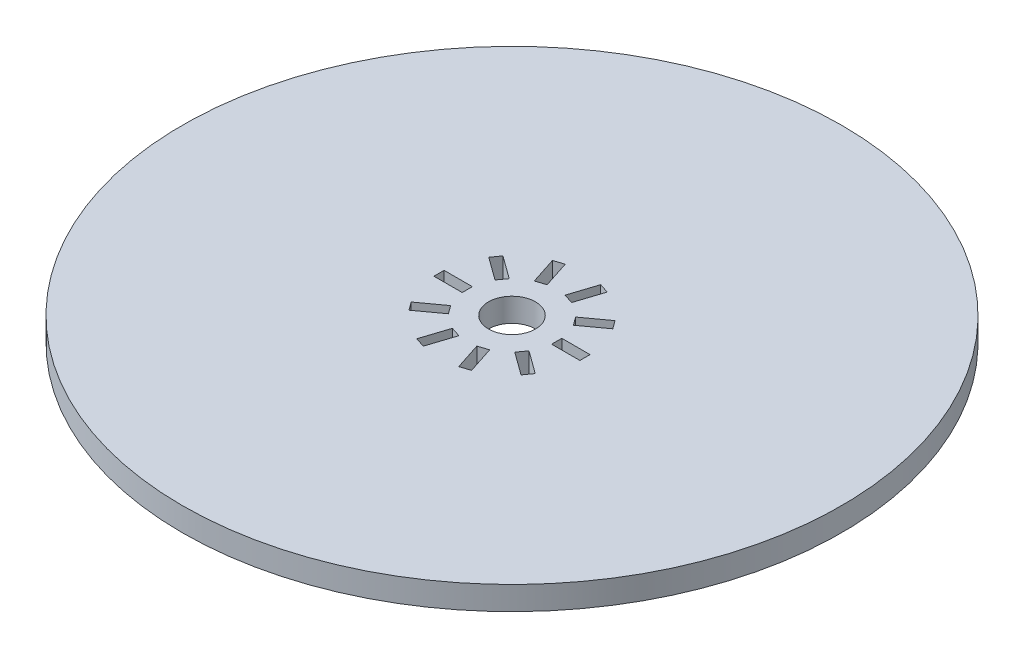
ISO-10303-21;
HEADER;
FILE_DESCRIPTION(('STEP AP214'),'2;1');
FILE_NAME('part.step','',(''),(''),'','','');
FILE_SCHEMA(('AUTOMOTIVE_DESIGN { 1 0 10303 214 1 1 1 1 }'));
ENDSEC;
DATA;
#1=APPLICATION_CONTEXT('core data for automotive mechanical design processes');
#2=APPLICATION_PROTOCOL_DEFINITION('international standard','automotive_design',2000,#1);
#3=PRODUCT_CONTEXT('',#1,'mechanical');
#4=PRODUCT('Part','Part','',(#3));
#5=PRODUCT_RELATED_PRODUCT_CATEGORY('part','',(#4));
#6=PRODUCT_DEFINITION_FORMATION('','',#4);
#7=PRODUCT_DEFINITION_CONTEXT('part definition',#1,'design');
#8=PRODUCT_DEFINITION('design','',#6,#7);
#9=PRODUCT_DEFINITION_SHAPE('','',#8);
#10=(LENGTH_UNIT() NAMED_UNIT(*) SI_UNIT(.MILLI.,.METRE.));
#11=(NAMED_UNIT(*) PLANE_ANGLE_UNIT() SI_UNIT($,.RADIAN.));
#12=(NAMED_UNIT(*) SI_UNIT($,.STERADIAN.) SOLID_ANGLE_UNIT());
#13=UNCERTAINTY_MEASURE_WITH_UNIT(LENGTH_MEASURE(1.E-05),#10,'distance_accuracy_value','');
#14=(GEOMETRIC_REPRESENTATION_CONTEXT(3) GLOBAL_UNCERTAINTY_ASSIGNED_CONTEXT((#13)) GLOBAL_UNIT_ASSIGNED_CONTEXT((#10,
#11,#12)) REPRESENTATION_CONTEXT('',''));
#15=CARTESIAN_POINT('',(0.,0.,0.));
#16=DIRECTION('',(0.,0.,1.));
#17=DIRECTION('',(1.,0.,0.));
#18=AXIS2_PLACEMENT_3D('',#15,#16,#17);
#19=CARTESIAN_POINT('',(0.,6.35,0.));
#20=DIRECTION('',(0.,-1.,0.));
#21=DIRECTION('',(0.,0.,-1.));
#22=AXIS2_PLACEMENT_3D('',#19,#20,#21);
#23=CYLINDRICAL_SURFACE('',#22,6.35);
#24=CARTESIAN_POINT('',(0.,6.35,0.));
#25=DIRECTION('',(0.,1.,0.));
#26=DIRECTION('',(0.,0.,1.));
#27=AXIS2_PLACEMENT_3D('',#24,#25,#26);
#28=CIRCLE('',#27,6.35);
#29=CARTESIAN_POINT('',(0.,6.35,6.35));
#30=VERTEX_POINT('',#29);
#31=EDGE_CURVE('E43',#30,#30,#28,.T.);
#32=ORIENTED_EDGE('',*,*,#31,.T.);
#33=EDGE_LOOP('',(#32));
#34=FACE_BOUND('',#33,.T.);
#35=CARTESIAN_POINT('',(0.,0.,0.));
#36=DIRECTION('',(0.,1.,0.));
#37=DIRECTION('',(0.,0.,1.));
#38=AXIS2_PLACEMENT_3D('',#35,#36,#37);
#39=CIRCLE('',#38,6.35);
#40=CARTESIAN_POINT('',(0.,0.,6.35));
#41=VERTEX_POINT('',#40);
#42=EDGE_CURVE('E611',#41,#41,#39,.T.);
#43=ORIENTED_EDGE('',*,*,#42,.F.);
#44=EDGE_LOOP('',(#43));
#45=FACE_BOUND('',#44,.T.);
#46=ADVANCED_FACE('F35',(#34,#45),#23,.F.);
#47=CARTESIAN_POINT('',(0.,6.35,0.));
#48=DIRECTION('',(0.,-1.,0.));
#49=DIRECTION('',(0.,0.,-1.));
#50=AXIS2_PLACEMENT_3D('',#47,#48,#49);
#51=CYLINDRICAL_SURFACE('',#50,88.9);
#52=CARTESIAN_POINT('',(0.,6.35,0.));
#53=DIRECTION('',(0.,1.,0.));
#54=DIRECTION('',(0.,0.,1.));
#55=AXIS2_PLACEMENT_3D('',#52,#53,#54);
#56=CIRCLE('',#55,88.9);
#57=CARTESIAN_POINT('',(0.,6.35,88.9));
#58=VERTEX_POINT('',#57);
#59=EDGE_CURVE('E11',#58,#58,#56,.T.);
#60=ORIENTED_EDGE('',*,*,#59,.F.);
#61=EDGE_LOOP('',(#60));
#62=FACE_BOUND('',#61,.T.);
#63=CARTESIAN_POINT('',(0.,0.,0.));
#64=DIRECTION('',(0.,1.,0.));
#65=DIRECTION('',(0.,0.,1.));
#66=AXIS2_PLACEMENT_3D('',#63,#64,#65);
#67=CIRCLE('',#66,88.9);
#68=CARTESIAN_POINT('',(0.,0.,88.9));
#69=VERTEX_POINT('',#68);
#70=EDGE_CURVE('E38',#69,#69,#67,.T.);
#71=ORIENTED_EDGE('',*,*,#70,.T.);
#72=EDGE_LOOP('',(#71));
#73=FACE_BOUND('',#72,.T.);
#74=ADVANCED_FACE('F625',(#62,#73),#51,.T.);
#75=CARTESIAN_POINT('',(0.,6.35,0.));
#76=DIRECTION('',(0.,1.,0.));
#77=DIRECTION('',(0.,0.,1.));
#78=AXIS2_PLACEMENT_3D('',#75,#76,#77);
#79=PLANE('',#78);
#80=DIRECTION('',(-0.587785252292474,0.,-0.809016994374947));
#81=VECTOR('',#80,1.);
#82=CARTESIAN_POINT('',(16.7317057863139,6.35,-10.4609049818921));
#83=LINE('',#82,#81);
#84=CARTESIAN_POINT('',(16.7317057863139,6.35,-10.4609049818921));
#85=VERTEX_POINT('',#84);
#86=CARTESIAN_POINT('',(15.1192932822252,6.35,-12.6802004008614));
#87=VERTEX_POINT('',#86);
#88=EDGE_CURVE('E51',#85,#87,#83,.T.);
#89=ORIENTED_EDGE('',*,*,#88,.F.);
#90=DIRECTION('',(0.809016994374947,0.,-0.587785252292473));
#91=VECTOR('',#90,1.);
#92=CARTESIAN_POINT('',(10.5669962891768,6.35,-5.98198135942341));
#93=LINE('',#92,#91);
#94=CARTESIAN_POINT('',(10.5669962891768,6.35,-5.98198135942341));
#95=VERTEX_POINT('',#94);
#96=EDGE_CURVE('E311',#95,#85,#93,.T.);
#97=ORIENTED_EDGE('',*,*,#96,.F.);
#98=DIRECTION('',(0.587785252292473,0.,0.809016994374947));
#99=VECTOR('',#98,1.);
#100=CARTESIAN_POINT('',(10.5669962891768,6.35,-5.98198135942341));
#101=LINE('',#100,#99);
#102=CARTESIAN_POINT('',(8.95458378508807,6.35,-8.20127677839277));
#103=VERTEX_POINT('',#102);
#104=EDGE_CURVE('E314',#103,#95,#101,.T.);
#105=ORIENTED_EDGE('',*,*,#104,.F.);
#106=DIRECTION('',(-0.809016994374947,0.,0.587785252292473));
#107=VECTOR('',#106,1.);
#108=CARTESIAN_POINT('',(8.95458378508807,6.35,-8.20127677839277));
#109=LINE('',#108,#107);
#110=EDGE_CURVE('E320',#87,#103,#109,.T.);
#111=ORIENTED_EDGE('',*,*,#110,.F.);
#112=EDGE_LOOP('',(#89,#97,#105,#111));
#113=FACE_BOUND('',#112,.T.);
#114=DIRECTION('',(-0.951056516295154,0.,-0.309016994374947));
#115=VECTOR('',#114,1.);
#116=CARTESIAN_POINT('',(7.38746865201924,6.35,-18.2976998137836));
#117=LINE('',#116,#115);
#118=CARTESIAN_POINT('',(7.38746865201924,6.35,-18.2976998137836));
#119=VERTEX_POINT('',#118);
#120=CARTESIAN_POINT('',(4.77853041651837,6.35,-19.1453952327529));
#121=VERTEX_POINT('',#120);
#122=EDGE_CURVE('E326',#119,#121,#117,.T.);
#123=ORIENTED_EDGE('',*,*,#122,.F.);
#124=DIRECTION('',(0.309016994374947,0.,-0.951056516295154));
#125=VECTOR('',#124,1.);
#126=CARTESIAN_POINT('',(5.03275915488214,6.35,-11.0506491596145));
#127=LINE('',#126,#125);
#128=CARTESIAN_POINT('',(5.03275915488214,6.35,-11.0506491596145));
#129=VERTEX_POINT('',#128);
#130=EDGE_CURVE('E334',#129,#119,#127,.T.);
#131=ORIENTED_EDGE('',*,*,#130,.F.);
#132=DIRECTION('',(0.951056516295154,0.,0.309016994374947));
#133=VECTOR('',#132,1.);
#134=CARTESIAN_POINT('',(5.03275915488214,6.35,-11.0506491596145));
#135=LINE('',#134,#133);
#136=CARTESIAN_POINT('',(2.42382091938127,6.35,-11.8983445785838));
#137=VERTEX_POINT('',#136);
#138=EDGE_CURVE('E348',#137,#129,#135,.T.);
#139=ORIENTED_EDGE('',*,*,#138,.F.);
#140=DIRECTION('',(-0.309016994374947,0.,0.951056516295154));
#141=VECTOR('',#140,1.);
#142=CARTESIAN_POINT('',(2.42382091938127,6.35,-11.8983445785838));
#143=LINE('',#142,#141);
#144=EDGE_CURVE('E345',#121,#137,#143,.T.);
#145=ORIENTED_EDGE('',*,*,#144,.F.);
#146=EDGE_LOOP('',(#123,#131,#139,#145));
#147=FACE_BOUND('',#146,.T.);
#148=DIRECTION('',(-0.951056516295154,0.,0.309016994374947));
#149=VECTOR('',#148,1.);
#150=CARTESIAN_POINT('',(-4.77853041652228,6.35,-19.1453952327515));
#151=LINE('',#150,#149);
#152=CARTESIAN_POINT('',(-4.77853041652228,6.35,-19.1453952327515));
#153=VERTEX_POINT('',#152);
#154=CARTESIAN_POINT('',(-7.38746865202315,6.35,-18.2976998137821));
#155=VERTEX_POINT('',#154);
#156=EDGE_CURVE('E355',#153,#155,#151,.T.);
#157=ORIENTED_EDGE('',*,*,#156,.F.);
#158=DIRECTION('',(-0.309016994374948,0.,-0.951056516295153));
#159=VECTOR('',#158,1.);
#160=CARTESIAN_POINT('',(-2.42382091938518,6.35,-11.8983445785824));
#161=LINE('',#160,#159);
#162=CARTESIAN_POINT('',(-2.42382091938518,6.35,-11.8983445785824));
#163=VERTEX_POINT('',#162);
#164=EDGE_CURVE('E366',#163,#153,#161,.T.);
#165=ORIENTED_EDGE('',*,*,#164,.F.);
#166=DIRECTION('',(0.951056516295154,0.,-0.309016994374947));
#167=VECTOR('',#166,1.);
#168=CARTESIAN_POINT('',(-2.42382091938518,6.35,-11.8983445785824));
#169=LINE('',#168,#167);
#170=CARTESIAN_POINT('',(-5.03275915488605,6.35,-11.0506491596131));
#171=VERTEX_POINT('',#170);
#172=EDGE_CURVE('E380',#171,#163,#169,.T.);
#173=ORIENTED_EDGE('',*,*,#172,.F.);
#174=DIRECTION('',(0.309016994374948,0.,0.951056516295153));
#175=VECTOR('',#174,1.);
#176=CARTESIAN_POINT('',(-5.03275915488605,6.35,-11.0506491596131));
#177=LINE('',#176,#175);
#178=EDGE_CURVE('E377',#155,#171,#177,.T.);
#179=ORIENTED_EDGE('',*,*,#178,.F.);
#180=EDGE_LOOP('',(#157,#165,#173,#179));
#181=FACE_BOUND('',#180,.T.);
#182=DIRECTION('',(-0.587785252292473,0.,0.809016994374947));
#183=VECTOR('',#182,1.);
#184=CARTESIAN_POINT('',(-15.1192932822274,6.35,-12.6802004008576));
#185=LINE('',#184,#183);
#186=CARTESIAN_POINT('',(-15.1192932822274,6.35,-12.6802004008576));
#187=VERTEX_POINT('',#186);
#188=CARTESIAN_POINT('',(-16.7317057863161,6.35,-10.4609049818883));
#189=VERTEX_POINT('',#188);
#190=EDGE_CURVE('E387',#187,#189,#185,.T.);
#191=ORIENTED_EDGE('',*,*,#190,.F.);
#192=DIRECTION('',(-0.809016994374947,0.,-0.587785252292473));
#193=VECTOR('',#192,1.);
#194=CARTESIAN_POINT('',(-8.95458378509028,6.35,-8.201276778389));
#195=LINE('',#194,#193);
#196=CARTESIAN_POINT('',(-8.95458378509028,6.35,-8.201276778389));
#197=VERTEX_POINT('',#196);
#198=EDGE_CURVE('E398',#197,#187,#195,.T.);
#199=ORIENTED_EDGE('',*,*,#198,.F.);
#200=DIRECTION('',(0.587785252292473,0.,-0.809016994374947));
#201=VECTOR('',#200,1.);
#202=CARTESIAN_POINT('',(-8.95458378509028,6.35,-8.201276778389));
#203=LINE('',#202,#201);
#204=CARTESIAN_POINT('',(-10.566996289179,6.35,-5.98198135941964));
#205=VERTEX_POINT('',#204);
#206=EDGE_CURVE('E412',#205,#197,#203,.T.);
#207=ORIENTED_EDGE('',*,*,#206,.F.);
#208=DIRECTION('',(0.809016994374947,0.,0.587785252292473));
#209=VECTOR('',#208,1.);
#210=CARTESIAN_POINT('',(-10.566996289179,6.35,-5.98198135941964));
#211=LINE('',#210,#209);
#212=EDGE_CURVE('E409',#189,#205,#211,.T.);
#213=ORIENTED_EDGE('',*,*,#212,.F.);
#214=EDGE_LOOP('',(#191,#199,#207,#213));
#215=FACE_BOUND('',#214,.T.);
#216=DIRECTION('',(0.,0.,1.));
#217=VECTOR('',#216,1.);
#218=CARTESIAN_POINT('',(-19.6849999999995,6.35,-1.37159999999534));
#219=LINE('',#218,#217);
#220=CARTESIAN_POINT('',(-19.6849999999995,6.35,-1.37159999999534));
#221=VERTEX_POINT('',#220);
#222=CARTESIAN_POINT('',(-19.6849999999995,6.35,1.37160000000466));
#223=VERTEX_POINT('',#222);
#224=EDGE_CURVE('E419',#221,#223,#219,.T.);
#225=ORIENTED_EDGE('',*,*,#224,.F.);
#226=DIRECTION('',(-1.,0.,0.));
#227=VECTOR('',#226,1.);
#228=CARTESIAN_POINT('',(-12.0649999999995,6.35,-1.37159999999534));
#229=LINE('',#228,#227);
#230=CARTESIAN_POINT('',(-12.0649999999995,6.35,-1.37159999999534));
#231=VERTEX_POINT('',#230);
#232=EDGE_CURVE('E430',#231,#221,#229,.T.);
#233=ORIENTED_EDGE('',*,*,#232,.F.);
#234=DIRECTION('',(0.,0.,-1.));
#235=VECTOR('',#234,1.);
#236=CARTESIAN_POINT('',(-12.0649999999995,6.35,-1.37159999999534));
#237=LINE('',#236,#235);
#238=CARTESIAN_POINT('',(-12.0649999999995,6.35,1.37160000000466));
#239=VERTEX_POINT('',#238);
#240=EDGE_CURVE('E444',#239,#231,#237,.T.);
#241=ORIENTED_EDGE('',*,*,#240,.F.);
#242=DIRECTION('',(1.,0.,0.));
#243=VECTOR('',#242,1.);
#244=CARTESIAN_POINT('',(-12.0649999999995,6.35,1.37160000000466));
#245=LINE('',#244,#243);
#246=EDGE_CURVE('E441',#223,#239,#245,.T.);
#247=ORIENTED_EDGE('',*,*,#246,.F.);
#248=EDGE_LOOP('',(#225,#233,#241,#247));
#249=FACE_BOUND('',#248,.T.);
#250=DIRECTION('',(0.587785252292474,0.,0.809016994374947));
#251=VECTOR('',#250,1.);
#252=CARTESIAN_POINT('',(-16.7317057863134,6.35,10.4609049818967));
#253=LINE('',#252,#251);
#254=CARTESIAN_POINT('',(-16.7317057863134,6.35,10.4609049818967));
#255=VERTEX_POINT('',#254);
#256=CARTESIAN_POINT('',(-15.1192932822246,6.35,12.6802004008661));
#257=VERTEX_POINT('',#256);
#258=EDGE_CURVE('E451',#255,#257,#253,.T.);
#259=ORIENTED_EDGE('',*,*,#258,.F.);
#260=DIRECTION('',(-0.809016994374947,0.,0.587785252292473));
#261=VECTOR('',#260,1.);
#262=CARTESIAN_POINT('',(-10.5669962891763,6.35,5.98198135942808));
#263=LINE('',#262,#261);
#264=CARTESIAN_POINT('',(-10.5669962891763,6.35,5.98198135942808));
#265=VERTEX_POINT('',#264);
#266=EDGE_CURVE('E462',#265,#255,#263,.T.);
#267=ORIENTED_EDGE('',*,*,#266,.F.);
#268=DIRECTION('',(-0.587785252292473,0.,-0.809016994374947));
#269=VECTOR('',#268,1.);
#270=CARTESIAN_POINT('',(-10.5669962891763,6.35,5.98198135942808));
#271=LINE('',#270,#269);
#272=CARTESIAN_POINT('',(-8.95458378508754,6.35,8.20127677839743));
#273=VERTEX_POINT('',#272);
#274=EDGE_CURVE('E476',#273,#265,#271,.T.);
#275=ORIENTED_EDGE('',*,*,#274,.F.);
#276=DIRECTION('',(0.809016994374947,0.,-0.587785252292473));
#277=VECTOR('',#276,1.);
#278=CARTESIAN_POINT('',(-8.95458378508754,6.35,8.20127677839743));
#279=LINE('',#278,#277);
#280=EDGE_CURVE('E473',#257,#273,#279,.T.);
#281=ORIENTED_EDGE('',*,*,#280,.F.);
#282=EDGE_LOOP('',(#259,#267,#275,#281));
#283=FACE_BOUND('',#282,.T.);
#284=DIRECTION('',(0.951056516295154,0.,0.309016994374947));
#285=VECTOR('',#284,1.);
#286=CARTESIAN_POINT('',(-7.38746865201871,6.35,18.2976998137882));
#287=LINE('',#286,#285);
#288=CARTESIAN_POINT('',(-7.38746865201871,6.35,18.2976998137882));
#289=VERTEX_POINT('',#288);
#290=CARTESIAN_POINT('',(-4.77853041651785,6.35,19.1453952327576));
#291=VERTEX_POINT('',#290);
#292=EDGE_CURVE('E483',#289,#291,#287,.T.);
#293=ORIENTED_EDGE('',*,*,#292,.F.);
#294=DIRECTION('',(-0.309016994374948,0.,0.951056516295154));
#295=VECTOR('',#294,1.);
#296=CARTESIAN_POINT('',(-5.03275915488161,6.35,11.0506491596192));
#297=LINE('',#296,#295);
#298=CARTESIAN_POINT('',(-5.03275915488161,6.35,11.0506491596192));
#299=VERTEX_POINT('',#298);
#300=EDGE_CURVE('E494',#299,#289,#297,.T.);
#301=ORIENTED_EDGE('',*,*,#300,.F.);
#302=DIRECTION('',(-0.951056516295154,0.,-0.309016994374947));
#303=VECTOR('',#302,1.);
#304=CARTESIAN_POINT('',(-5.03275915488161,6.35,11.0506491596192));
#305=LINE('',#304,#303);
#306=CARTESIAN_POINT('',(-2.42382091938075,6.35,11.8983445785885));
#307=VERTEX_POINT('',#306);
#308=EDGE_CURVE('E508',#307,#299,#305,.T.);
#309=ORIENTED_EDGE('',*,*,#308,.F.);
#310=DIRECTION('',(0.309016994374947,0.,-0.951056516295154));
#311=VECTOR('',#310,1.);
#312=CARTESIAN_POINT('',(-2.42382091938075,6.35,11.8983445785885));
#313=LINE('',#312,#311);
#314=EDGE_CURVE('E505',#291,#307,#313,.T.);
#315=ORIENTED_EDGE('',*,*,#314,.F.);
#316=EDGE_LOOP('',(#293,#301,#309,#315));
#317=FACE_BOUND('',#316,.T.);
#318=DIRECTION('',(0.951056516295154,0.,-0.309016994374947));
#319=VECTOR('',#318,1.);
#320=CARTESIAN_POINT('',(4.77853041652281,6.35,19.1453952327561));
#321=LINE('',#320,#319);
#322=CARTESIAN_POINT('',(4.77853041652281,6.35,19.1453952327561));
#323=VERTEX_POINT('',#322);
#324=CARTESIAN_POINT('',(7.38746865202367,6.35,18.2976998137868));
#325=VERTEX_POINT('',#324);
#326=EDGE_CURVE('E515',#323,#325,#321,.T.);
#327=ORIENTED_EDGE('',*,*,#326,.F.);
#328=DIRECTION('',(0.309016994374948,0.,0.951056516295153));
#329=VECTOR('',#328,1.);
#330=CARTESIAN_POINT('',(2.42382091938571,6.35,11.8983445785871));
#331=LINE('',#330,#329);
#332=CARTESIAN_POINT('',(2.42382091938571,6.35,11.8983445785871));
#333=VERTEX_POINT('',#332);
#334=EDGE_CURVE('E526',#333,#323,#331,.T.);
#335=ORIENTED_EDGE('',*,*,#334,.F.);
#336=DIRECTION('',(-0.951056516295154,0.,0.309016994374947));
#337=VECTOR('',#336,1.);
#338=CARTESIAN_POINT('',(2.42382091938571,6.35,11.8983445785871));
#339=LINE('',#338,#337);
#340=CARTESIAN_POINT('',(5.03275915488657,6.35,11.0506491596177));
#341=VERTEX_POINT('',#340);
#342=EDGE_CURVE('E540',#341,#333,#339,.T.);
#343=ORIENTED_EDGE('',*,*,#342,.F.);
#344=DIRECTION('',(-0.309016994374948,0.,-0.951056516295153));
#345=VECTOR('',#344,1.);
#346=CARTESIAN_POINT('',(5.03275915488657,6.35,11.0506491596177));
#347=LINE('',#346,#345);
#348=EDGE_CURVE('E537',#325,#341,#347,.T.);
#349=ORIENTED_EDGE('',*,*,#348,.F.);
#350=EDGE_LOOP('',(#327,#335,#343,#349));
#351=FACE_BOUND('',#350,.T.);
#352=DIRECTION('',(0.587785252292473,0.,-0.809016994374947));
#353=VECTOR('',#352,1.);
#354=CARTESIAN_POINT('',(15.1192932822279,6.35,12.6802004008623));
#355=LINE('',#354,#353);
#356=CARTESIAN_POINT('',(15.1192932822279,6.35,12.6802004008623));
#357=VERTEX_POINT('',#356);
#358=CARTESIAN_POINT('',(16.7317057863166,6.35,10.4609049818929));
#359=VERTEX_POINT('',#358);
#360=EDGE_CURVE('E547',#357,#359,#355,.T.);
#361=ORIENTED_EDGE('',*,*,#360,.F.);
#362=DIRECTION('',(0.809016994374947,0.,0.587785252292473));
#363=VECTOR('',#362,1.);
#364=CARTESIAN_POINT('',(8.95458378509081,6.35,8.20127677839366));
#365=LINE('',#364,#363);
#366=CARTESIAN_POINT('',(8.95458378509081,6.35,8.20127677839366));
#367=VERTEX_POINT('',#366);
#368=EDGE_CURVE('E558',#367,#357,#365,.T.);
#369=ORIENTED_EDGE('',*,*,#368,.F.);
#370=DIRECTION('',(-0.587785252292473,0.,0.809016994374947));
#371=VECTOR('',#370,1.);
#372=CARTESIAN_POINT('',(8.95458378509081,6.35,8.20127677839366));
#373=LINE('',#372,#371);
#374=CARTESIAN_POINT('',(10.5669962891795,6.35,5.9819813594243));
#375=VERTEX_POINT('',#374);
#376=EDGE_CURVE('E572',#375,#367,#373,.T.);
#377=ORIENTED_EDGE('',*,*,#376,.F.);
#378=DIRECTION('',(-0.809016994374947,0.,-0.587785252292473));
#379=VECTOR('',#378,1.);
#380=CARTESIAN_POINT('',(10.5669962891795,6.35,5.9819813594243));
#381=LINE('',#380,#379);
#382=EDGE_CURVE('E569',#359,#375,#381,.T.);
#383=ORIENTED_EDGE('',*,*,#382,.F.);
#384=EDGE_LOOP('',(#361,#369,#377,#383));
#385=FACE_BOUND('',#384,.T.);
#386=DIRECTION('',(0.,0.,-1.));
#387=VECTOR('',#386,1.);
#388=CARTESIAN_POINT('',(19.685,6.35,1.3716));
#389=LINE('',#388,#387);
#390=CARTESIAN_POINT('',(19.685,6.35,1.3716));
#391=VERTEX_POINT('',#390);
#392=CARTESIAN_POINT('',(19.685,6.35,-1.3716));
#393=VERTEX_POINT('',#392);
#394=EDGE_CURVE('E579',#391,#393,#389,.T.);
#395=ORIENTED_EDGE('',*,*,#394,.F.);
#396=DIRECTION('',(1.,0.,0.));
#397=VECTOR('',#396,1.);
#398=CARTESIAN_POINT('',(12.065,6.35,1.3716));
#399=LINE('',#398,#397);
#400=CARTESIAN_POINT('',(12.065,6.35,1.3716));
#401=VERTEX_POINT('',#400);
#402=EDGE_CURVE('E590',#401,#391,#399,.T.);
#403=ORIENTED_EDGE('',*,*,#402,.F.);
#404=DIRECTION('',(0.,0.,1.));
#405=VECTOR('',#404,1.);
#406=CARTESIAN_POINT('',(12.065,6.35,1.3716));
#407=LINE('',#406,#405);
#408=CARTESIAN_POINT('',(12.065,6.35,-1.3716));
#409=VERTEX_POINT('',#408);
#410=EDGE_CURVE('E604',#409,#401,#407,.T.);
#411=ORIENTED_EDGE('',*,*,#410,.F.);
#412=DIRECTION('',(-1.,0.,0.));
#413=VECTOR('',#412,1.);
#414=CARTESIAN_POINT('',(12.065,6.35,-1.3716));
#415=LINE('',#414,#413);
#416=EDGE_CURVE('E601',#393,#409,#415,.T.);
#417=ORIENTED_EDGE('',*,*,#416,.F.);
#418=EDGE_LOOP('',(#395,#403,#411,#417));
#419=FACE_BOUND('',#418,.T.);
#420=ORIENTED_EDGE('',*,*,#31,.F.);
#421=EDGE_LOOP('',(#420));
#422=FACE_BOUND('',#421,.T.);
#423=ORIENTED_EDGE('',*,*,#59,.T.);
#424=EDGE_LOOP('',(#423));
#425=FACE_BOUND('',#424,.T.);
#426=ADVANCED_FACE('F629',(#113,#147,#181,#215,#249,#283,#317,#351,#385,#419,#422,#425),#79,.T.);
#427=CARTESIAN_POINT('',(0.,0.,0.));
#428=DIRECTION('',(0.,1.,0.));
#429=DIRECTION('',(0.,0.,1.));
#430=AXIS2_PLACEMENT_3D('',#427,#428,#429);
#431=PLANE('',#430);
#432=DIRECTION('',(0.809016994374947,0.,-0.587785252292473));
#433=VECTOR('',#432,1.);
#434=CARTESIAN_POINT('',(10.5669962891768,0.,-5.98198135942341));
#435=LINE('',#434,#433);
#436=CARTESIAN_POINT('',(10.5669962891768,0.,-5.98198135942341));
#437=VERTEX_POINT('',#436);
#438=CARTESIAN_POINT('',(16.7317057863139,0.,-10.4609049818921));
#439=VERTEX_POINT('',#438);
#440=EDGE_CURVE('E301',#437,#439,#435,.T.);
#441=ORIENTED_EDGE('',*,*,#440,.T.);
#442=DIRECTION('',(-0.587785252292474,0.,-0.809016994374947));
#443=VECTOR('',#442,1.);
#444=CARTESIAN_POINT('',(16.7317057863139,0.,-10.4609049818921));
#445=LINE('',#444,#443);
#446=CARTESIAN_POINT('',(15.1192932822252,0.,-12.6802004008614));
#447=VERTEX_POINT('',#446);
#448=EDGE_CURVE('E295',#439,#447,#445,.T.);
#449=ORIENTED_EDGE('',*,*,#448,.T.);
#450=DIRECTION('',(-0.809016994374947,0.,0.587785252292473));
#451=VECTOR('',#450,1.);
#452=CARTESIAN_POINT('',(8.95458378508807,0.,-8.20127677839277));
#453=LINE('',#452,#451);
#454=CARTESIAN_POINT('',(8.95458378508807,0.,-8.20127677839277));
#455=VERTEX_POINT('',#454);
#456=EDGE_CURVE('E304',#447,#455,#453,.T.);
#457=ORIENTED_EDGE('',*,*,#456,.T.);
#458=DIRECTION('',(0.587785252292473,0.,0.809016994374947));
#459=VECTOR('',#458,1.);
#460=CARTESIAN_POINT('',(10.5669962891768,0.,-5.98198135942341));
#461=LINE('',#460,#459);
#462=EDGE_CURVE('E59',#455,#437,#461,.T.);
#463=ORIENTED_EDGE('',*,*,#462,.T.);
#464=EDGE_LOOP('',(#441,#449,#457,#463));
#465=FACE_BOUND('',#464,.T.);
#466=DIRECTION('',(0.309016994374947,0.,-0.951056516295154));
#467=VECTOR('',#466,1.);
#468=CARTESIAN_POINT('',(5.03275915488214,0.,-11.0506491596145));
#469=LINE('',#468,#467);
#470=CARTESIAN_POINT('',(5.03275915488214,0.,-11.0506491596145));
#471=VERTEX_POINT('',#470);
#472=CARTESIAN_POINT('',(7.38746865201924,0.,-18.2976998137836));
#473=VERTEX_POINT('',#472);
#474=EDGE_CURVE('E340',#471,#473,#469,.T.);
#475=ORIENTED_EDGE('',*,*,#474,.T.);
#476=DIRECTION('',(-0.951056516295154,0.,-0.309016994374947));
#477=VECTOR('',#476,1.);
#478=CARTESIAN_POINT('',(7.38746865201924,0.,-18.2976998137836));
#479=LINE('',#478,#477);
#480=CARTESIAN_POINT('',(4.77853041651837,0.,-19.1453952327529));
#481=VERTEX_POINT('',#480);
#482=EDGE_CURVE('E330',#473,#481,#479,.T.);
#483=ORIENTED_EDGE('',*,*,#482,.T.);
#484=DIRECTION('',(-0.309016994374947,0.,0.951056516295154));
#485=VECTOR('',#484,1.);
#486=CARTESIAN_POINT('',(2.42382091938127,0.,-11.8983445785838));
#487=LINE('',#486,#485);
#488=CARTESIAN_POINT('',(2.42382091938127,0.,-11.8983445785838));
#489=VERTEX_POINT('',#488);
#490=EDGE_CURVE('E333',#481,#489,#487,.T.);
#491=ORIENTED_EDGE('',*,*,#490,.T.);
#492=DIRECTION('',(0.951056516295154,0.,0.309016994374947));
#493=VECTOR('',#492,1.);
#494=CARTESIAN_POINT('',(5.03275915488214,0.,-11.0506491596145));
#495=LINE('',#494,#493);
#496=EDGE_CURVE('E337',#489,#471,#495,.T.);
#497=ORIENTED_EDGE('',*,*,#496,.T.);
#498=EDGE_LOOP('',(#475,#483,#491,#497));
#499=FACE_BOUND('',#498,.T.);
#500=DIRECTION('',(-0.309016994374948,0.,-0.951056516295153));
#501=VECTOR('',#500,1.);
#502=CARTESIAN_POINT('',(-2.42382091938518,0.,-11.8983445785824));
#503=LINE('',#502,#501);
#504=CARTESIAN_POINT('',(-2.42382091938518,0.,-11.8983445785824));
#505=VERTEX_POINT('',#504);
#506=CARTESIAN_POINT('',(-4.77853041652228,0.,-19.1453952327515));
#507=VERTEX_POINT('',#506);
#508=EDGE_CURVE('E372',#505,#507,#503,.T.);
#509=ORIENTED_EDGE('',*,*,#508,.T.);
#510=DIRECTION('',(-0.951056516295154,0.,0.309016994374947));
#511=VECTOR('',#510,1.);
#512=CARTESIAN_POINT('',(-4.77853041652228,0.,-19.1453952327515));
#513=LINE('',#512,#511);
#514=CARTESIAN_POINT('',(-7.38746865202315,0.,-18.2976998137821));
#515=VERTEX_POINT('',#514);
#516=EDGE_CURVE('E362',#507,#515,#513,.T.);
#517=ORIENTED_EDGE('',*,*,#516,.T.);
#518=DIRECTION('',(0.309016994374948,0.,0.951056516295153));
#519=VECTOR('',#518,1.);
#520=CARTESIAN_POINT('',(-5.03275915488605,0.,-11.0506491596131));
#521=LINE('',#520,#519);
#522=CARTESIAN_POINT('',(-5.03275915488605,0.,-11.0506491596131));
#523=VERTEX_POINT('',#522);
#524=EDGE_CURVE('E365',#515,#523,#521,.T.);
#525=ORIENTED_EDGE('',*,*,#524,.T.);
#526=DIRECTION('',(0.951056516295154,0.,-0.309016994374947));
#527=VECTOR('',#526,1.);
#528=CARTESIAN_POINT('',(-2.42382091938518,0.,-11.8983445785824));
#529=LINE('',#528,#527);
#530=EDGE_CURVE('E369',#523,#505,#529,.T.);
#531=ORIENTED_EDGE('',*,*,#530,.T.);
#532=EDGE_LOOP('',(#509,#517,#525,#531));
#533=FACE_BOUND('',#532,.T.);
#534=DIRECTION('',(-0.809016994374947,0.,-0.587785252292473));
#535=VECTOR('',#534,1.);
#536=CARTESIAN_POINT('',(-8.95458378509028,0.,-8.201276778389));
#537=LINE('',#536,#535);
#538=CARTESIAN_POINT('',(-8.95458378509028,0.,-8.201276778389));
#539=VERTEX_POINT('',#538);
#540=CARTESIAN_POINT('',(-15.1192932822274,0.,-12.6802004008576));
#541=VERTEX_POINT('',#540);
#542=EDGE_CURVE('E404',#539,#541,#537,.T.);
#543=ORIENTED_EDGE('',*,*,#542,.T.);
#544=DIRECTION('',(-0.587785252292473,0.,0.809016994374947));
#545=VECTOR('',#544,1.);
#546=CARTESIAN_POINT('',(-15.1192932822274,0.,-12.6802004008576));
#547=LINE('',#546,#545);
#548=CARTESIAN_POINT('',(-16.7317057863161,0.,-10.4609049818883));
#549=VERTEX_POINT('',#548);
#550=EDGE_CURVE('E394',#541,#549,#547,.T.);
#551=ORIENTED_EDGE('',*,*,#550,.T.);
#552=DIRECTION('',(0.809016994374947,0.,0.587785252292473));
#553=VECTOR('',#552,1.);
#554=CARTESIAN_POINT('',(-10.566996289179,0.,-5.98198135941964));
#555=LINE('',#554,#553);
#556=CARTESIAN_POINT('',(-10.566996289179,0.,-5.98198135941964));
#557=VERTEX_POINT('',#556);
#558=EDGE_CURVE('E397',#549,#557,#555,.T.);
#559=ORIENTED_EDGE('',*,*,#558,.T.);
#560=DIRECTION('',(0.587785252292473,0.,-0.809016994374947));
#561=VECTOR('',#560,1.);
#562=CARTESIAN_POINT('',(-8.95458378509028,0.,-8.201276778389));
#563=LINE('',#562,#561);
#564=EDGE_CURVE('E401',#557,#539,#563,.T.);
#565=ORIENTED_EDGE('',*,*,#564,.T.);
#566=EDGE_LOOP('',(#543,#551,#559,#565));
#567=FACE_BOUND('',#566,.T.);
#568=DIRECTION('',(-1.,0.,0.));
#569=VECTOR('',#568,1.);
#570=CARTESIAN_POINT('',(-12.0649999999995,0.,-1.37159999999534));
#571=LINE('',#570,#569);
#572=CARTESIAN_POINT('',(-12.0649999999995,0.,-1.37159999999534));
#573=VERTEX_POINT('',#572);
#574=CARTESIAN_POINT('',(-19.6849999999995,0.,-1.37159999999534));
#575=VERTEX_POINT('',#574);
#576=EDGE_CURVE('E436',#573,#575,#571,.T.);
#577=ORIENTED_EDGE('',*,*,#576,.T.);
#578=DIRECTION('',(0.,0.,1.));
#579=VECTOR('',#578,1.);
#580=CARTESIAN_POINT('',(-19.6849999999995,0.,-1.37159999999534));
#581=LINE('',#580,#579);
#582=CARTESIAN_POINT('',(-19.6849999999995,0.,1.37160000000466));
#583=VERTEX_POINT('',#582);
#584=EDGE_CURVE('E426',#575,#583,#581,.T.);
#585=ORIENTED_EDGE('',*,*,#584,.T.);
#586=DIRECTION('',(1.,0.,0.));
#587=VECTOR('',#586,1.);
#588=CARTESIAN_POINT('',(-12.0649999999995,0.,1.37160000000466));
#589=LINE('',#588,#587);
#590=CARTESIAN_POINT('',(-12.0649999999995,0.,1.37160000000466));
#591=VERTEX_POINT('',#590);
#592=EDGE_CURVE('E429',#583,#591,#589,.T.);
#593=ORIENTED_EDGE('',*,*,#592,.T.);
#594=DIRECTION('',(0.,0.,-1.));
#595=VECTOR('',#594,1.);
#596=CARTESIAN_POINT('',(-12.0649999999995,0.,-1.37159999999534));
#597=LINE('',#596,#595);
#598=EDGE_CURVE('E433',#591,#573,#597,.T.);
#599=ORIENTED_EDGE('',*,*,#598,.T.);
#600=EDGE_LOOP('',(#577,#585,#593,#599));
#601=FACE_BOUND('',#600,.T.);
#602=DIRECTION('',(-0.809016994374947,0.,0.587785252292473));
#603=VECTOR('',#602,1.);
#604=CARTESIAN_POINT('',(-10.5669962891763,0.,5.98198135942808));
#605=LINE('',#604,#603);
#606=CARTESIAN_POINT('',(-10.5669962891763,0.,5.98198135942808));
#607=VERTEX_POINT('',#606);
#608=CARTESIAN_POINT('',(-16.7317057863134,0.,10.4609049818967));
#609=VERTEX_POINT('',#608);
#610=EDGE_CURVE('E468',#607,#609,#605,.T.);
#611=ORIENTED_EDGE('',*,*,#610,.T.);
#612=DIRECTION('',(0.587785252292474,0.,0.809016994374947));
#613=VECTOR('',#612,1.);
#614=CARTESIAN_POINT('',(-16.7317057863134,0.,10.4609049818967));
#615=LINE('',#614,#613);
#616=CARTESIAN_POINT('',(-15.1192932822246,0.,12.6802004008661));
#617=VERTEX_POINT('',#616);
#618=EDGE_CURVE('E458',#609,#617,#615,.T.);
#619=ORIENTED_EDGE('',*,*,#618,.T.);
#620=DIRECTION('',(0.809016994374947,0.,-0.587785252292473));
#621=VECTOR('',#620,1.);
#622=CARTESIAN_POINT('',(-8.95458378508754,0.,8.20127677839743));
#623=LINE('',#622,#621);
#624=CARTESIAN_POINT('',(-8.95458378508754,0.,8.20127677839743));
#625=VERTEX_POINT('',#624);
#626=EDGE_CURVE('E461',#617,#625,#623,.T.);
#627=ORIENTED_EDGE('',*,*,#626,.T.);
#628=DIRECTION('',(-0.587785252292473,0.,-0.809016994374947));
#629=VECTOR('',#628,1.);
#630=CARTESIAN_POINT('',(-10.5669962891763,0.,5.98198135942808));
#631=LINE('',#630,#629);
#632=EDGE_CURVE('E465',#625,#607,#631,.T.);
#633=ORIENTED_EDGE('',*,*,#632,.T.);
#634=EDGE_LOOP('',(#611,#619,#627,#633));
#635=FACE_BOUND('',#634,.T.);
#636=DIRECTION('',(-0.309016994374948,0.,0.951056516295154));
#637=VECTOR('',#636,1.);
#638=CARTESIAN_POINT('',(-5.03275915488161,0.,11.0506491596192));
#639=LINE('',#638,#637);
#640=CARTESIAN_POINT('',(-5.03275915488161,0.,11.0506491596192));
#641=VERTEX_POINT('',#640);
#642=CARTESIAN_POINT('',(-7.38746865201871,0.,18.2976998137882));
#643=VERTEX_POINT('',#642);
#644=EDGE_CURVE('E500',#641,#643,#639,.T.);
#645=ORIENTED_EDGE('',*,*,#644,.T.);
#646=DIRECTION('',(0.951056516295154,0.,0.309016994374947));
#647=VECTOR('',#646,1.);
#648=CARTESIAN_POINT('',(-7.38746865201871,0.,18.2976998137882));
#649=LINE('',#648,#647);
#650=CARTESIAN_POINT('',(-4.77853041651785,0.,19.1453952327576));
#651=VERTEX_POINT('',#650);
#652=EDGE_CURVE('E490',#643,#651,#649,.T.);
#653=ORIENTED_EDGE('',*,*,#652,.T.);
#654=DIRECTION('',(0.309016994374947,0.,-0.951056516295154));
#655=VECTOR('',#654,1.);
#656=CARTESIAN_POINT('',(-2.42382091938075,0.,11.8983445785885));
#657=LINE('',#656,#655);
#658=CARTESIAN_POINT('',(-2.42382091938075,0.,11.8983445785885));
#659=VERTEX_POINT('',#658);
#660=EDGE_CURVE('E493',#651,#659,#657,.T.);
#661=ORIENTED_EDGE('',*,*,#660,.T.);
#662=DIRECTION('',(-0.951056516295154,0.,-0.309016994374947));
#663=VECTOR('',#662,1.);
#664=CARTESIAN_POINT('',(-5.03275915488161,0.,11.0506491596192));
#665=LINE('',#664,#663);
#666=EDGE_CURVE('E497',#659,#641,#665,.T.);
#667=ORIENTED_EDGE('',*,*,#666,.T.);
#668=EDGE_LOOP('',(#645,#653,#661,#667));
#669=FACE_BOUND('',#668,.T.);
#670=DIRECTION('',(0.309016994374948,0.,0.951056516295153));
#671=VECTOR('',#670,1.);
#672=CARTESIAN_POINT('',(2.42382091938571,0.,11.8983445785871));
#673=LINE('',#672,#671);
#674=CARTESIAN_POINT('',(2.42382091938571,0.,11.8983445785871));
#675=VERTEX_POINT('',#674);
#676=CARTESIAN_POINT('',(4.77853041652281,0.,19.1453952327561));
#677=VERTEX_POINT('',#676);
#678=EDGE_CURVE('E532',#675,#677,#673,.T.);
#679=ORIENTED_EDGE('',*,*,#678,.T.);
#680=DIRECTION('',(0.951056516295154,0.,-0.309016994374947));
#681=VECTOR('',#680,1.);
#682=CARTESIAN_POINT('',(4.77853041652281,0.,19.1453952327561));
#683=LINE('',#682,#681);
#684=CARTESIAN_POINT('',(7.38746865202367,0.,18.2976998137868));
#685=VERTEX_POINT('',#684);
#686=EDGE_CURVE('E522',#677,#685,#683,.T.);
#687=ORIENTED_EDGE('',*,*,#686,.T.);
#688=DIRECTION('',(-0.309016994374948,0.,-0.951056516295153));
#689=VECTOR('',#688,1.);
#690=CARTESIAN_POINT('',(5.03275915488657,0.,11.0506491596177));
#691=LINE('',#690,#689);
#692=CARTESIAN_POINT('',(5.03275915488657,0.,11.0506491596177));
#693=VERTEX_POINT('',#692);
#694=EDGE_CURVE('E525',#685,#693,#691,.T.);
#695=ORIENTED_EDGE('',*,*,#694,.T.);
#696=DIRECTION('',(-0.951056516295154,0.,0.309016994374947));
#697=VECTOR('',#696,1.);
#698=CARTESIAN_POINT('',(2.42382091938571,0.,11.8983445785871));
#699=LINE('',#698,#697);
#700=EDGE_CURVE('E529',#693,#675,#699,.T.);
#701=ORIENTED_EDGE('',*,*,#700,.T.);
#702=EDGE_LOOP('',(#679,#687,#695,#701));
#703=FACE_BOUND('',#702,.T.);
#704=DIRECTION('',(0.809016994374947,0.,0.587785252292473));
#705=VECTOR('',#704,1.);
#706=CARTESIAN_POINT('',(8.95458378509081,0.,8.20127677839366));
#707=LINE('',#706,#705);
#708=CARTESIAN_POINT('',(8.95458378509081,0.,8.20127677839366));
#709=VERTEX_POINT('',#708);
#710=CARTESIAN_POINT('',(15.1192932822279,0.,12.6802004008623));
#711=VERTEX_POINT('',#710);
#712=EDGE_CURVE('E564',#709,#711,#707,.T.);
#713=ORIENTED_EDGE('',*,*,#712,.T.);
#714=DIRECTION('',(0.587785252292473,0.,-0.809016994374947));
#715=VECTOR('',#714,1.);
#716=CARTESIAN_POINT('',(15.1192932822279,0.,12.6802004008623));
#717=LINE('',#716,#715);
#718=CARTESIAN_POINT('',(16.7317057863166,0.,10.4609049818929));
#719=VERTEX_POINT('',#718);
#720=EDGE_CURVE('E554',#711,#719,#717,.T.);
#721=ORIENTED_EDGE('',*,*,#720,.T.);
#722=DIRECTION('',(-0.809016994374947,0.,-0.587785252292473));
#723=VECTOR('',#722,1.);
#724=CARTESIAN_POINT('',(10.5669962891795,0.,5.9819813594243));
#725=LINE('',#724,#723);
#726=CARTESIAN_POINT('',(10.5669962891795,0.,5.9819813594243));
#727=VERTEX_POINT('',#726);
#728=EDGE_CURVE('E557',#719,#727,#725,.T.);
#729=ORIENTED_EDGE('',*,*,#728,.T.);
#730=DIRECTION('',(-0.587785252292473,0.,0.809016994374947));
#731=VECTOR('',#730,1.);
#732=CARTESIAN_POINT('',(8.95458378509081,0.,8.20127677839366));
#733=LINE('',#732,#731);
#734=EDGE_CURVE('E561',#727,#709,#733,.T.);
#735=ORIENTED_EDGE('',*,*,#734,.T.);
#736=EDGE_LOOP('',(#713,#721,#729,#735));
#737=FACE_BOUND('',#736,.T.);
#738=DIRECTION('',(1.,0.,0.));
#739=VECTOR('',#738,1.);
#740=CARTESIAN_POINT('',(12.065,0.,1.3716));
#741=LINE('',#740,#739);
#742=CARTESIAN_POINT('',(12.065,0.,1.3716));
#743=VERTEX_POINT('',#742);
#744=CARTESIAN_POINT('',(19.685,0.,1.3716));
#745=VERTEX_POINT('',#744);
#746=EDGE_CURVE('E596',#743,#745,#741,.T.);
#747=ORIENTED_EDGE('',*,*,#746,.T.);
#748=DIRECTION('',(0.,0.,-1.));
#749=VECTOR('',#748,1.);
#750=CARTESIAN_POINT('',(19.685,0.,1.3716));
#751=LINE('',#750,#749);
#752=CARTESIAN_POINT('',(19.685,0.,-1.3716));
#753=VERTEX_POINT('',#752);
#754=EDGE_CURVE('E586',#745,#753,#751,.T.);
#755=ORIENTED_EDGE('',*,*,#754,.T.);
#756=DIRECTION('',(-1.,0.,0.));
#757=VECTOR('',#756,1.);
#758=CARTESIAN_POINT('',(12.065,0.,-1.3716));
#759=LINE('',#758,#757);
#760=CARTESIAN_POINT('',(12.065,0.,-1.3716));
#761=VERTEX_POINT('',#760);
#762=EDGE_CURVE('E589',#753,#761,#759,.T.);
#763=ORIENTED_EDGE('',*,*,#762,.T.);
#764=DIRECTION('',(0.,0.,1.));
#765=VECTOR('',#764,1.);
#766=CARTESIAN_POINT('',(12.065,0.,1.3716));
#767=LINE('',#766,#765);
#768=EDGE_CURVE('E593',#761,#743,#767,.T.);
#769=ORIENTED_EDGE('',*,*,#768,.T.);
#770=EDGE_LOOP('',(#747,#755,#763,#769));
#771=FACE_BOUND('',#770,.T.);
#772=ORIENTED_EDGE('',*,*,#42,.T.);
#773=EDGE_LOOP('',(#772));
#774=FACE_BOUND('',#773,.T.);
#775=ORIENTED_EDGE('',*,*,#70,.F.);
#776=EDGE_LOOP('',(#775));
#777=FACE_BOUND('',#776,.T.);
#778=ADVANCED_FACE('F308',(#465,#499,#533,#567,#601,#635,#669,#703,#737,#771,#774,#777),#431,.F.);
#779=CARTESIAN_POINT('',(19.685,0.,1.3716));
#780=DIRECTION('',(1.,0.,0.));
#781=DIRECTION('',(0.,0.,-1.));
#782=AXIS2_PLACEMENT_3D('',#779,#780,#781);
#783=PLANE('',#782);
#784=ORIENTED_EDGE('',*,*,#394,.T.);
#785=DIRECTION('',(0.,1.,0.));
#786=VECTOR('',#785,1.);
#787=CARTESIAN_POINT('',(19.685,0.,-1.3716));
#788=LINE('',#787,#786);
#789=EDGE_CURVE('E599',#753,#393,#788,.T.);
#790=ORIENTED_EDGE('',*,*,#789,.F.);
#791=ORIENTED_EDGE('',*,*,#754,.F.);
#792=DIRECTION('',(0.,1.,0.));
#793=VECTOR('',#792,1.);
#794=CARTESIAN_POINT('',(19.685,0.,1.3716));
#795=LINE('',#794,#793);
#796=EDGE_CURVE('E609',#745,#391,#795,.T.);
#797=ORIENTED_EDGE('',*,*,#796,.T.);
#798=EDGE_LOOP('',(#784,#790,#791,#797));
#799=FACE_BOUND('',#798,.T.);
#800=ADVANCED_FACE('F628',(#799),#783,.F.);
#801=CARTESIAN_POINT('',(12.065,0.,1.3716));
#802=DIRECTION('',(0.,0.,1.));
#803=DIRECTION('',(1.,0.,0.));
#804=AXIS2_PLACEMENT_3D('',#801,#802,#803);
#805=PLANE('',#804);
#806=ORIENTED_EDGE('',*,*,#402,.T.);
#807=ORIENTED_EDGE('',*,*,#796,.F.);
#808=ORIENTED_EDGE('',*,*,#746,.F.);
#809=DIRECTION('',(0.,1.,0.));
#810=VECTOR('',#809,1.);
#811=CARTESIAN_POINT('',(12.065,0.,1.3716));
#812=LINE('',#811,#810);
#813=EDGE_CURVE('E612',#743,#401,#812,.T.);
#814=ORIENTED_EDGE('',*,*,#813,.T.);
#815=EDGE_LOOP('',(#806,#807,#808,#814));
#816=FACE_BOUND('',#815,.T.);
#817=ADVANCED_FACE('F635',(#816),#805,.F.);
#818=CARTESIAN_POINT('',(12.065,0.,1.3716));
#819=DIRECTION('',(-1.,0.,0.));
#820=DIRECTION('',(0.,0.,1.));
#821=AXIS2_PLACEMENT_3D('',#818,#819,#820);
#822=PLANE('',#821);
#823=ORIENTED_EDGE('',*,*,#410,.T.);
#824=ORIENTED_EDGE('',*,*,#813,.F.);
#825=ORIENTED_EDGE('',*,*,#768,.F.);
#826=DIRECTION('',(0.,1.,0.));
#827=VECTOR('',#826,1.);
#828=CARTESIAN_POINT('',(12.065,0.,-1.3716));
#829=LINE('',#828,#827);
#830=EDGE_CURVE('E614',#761,#409,#829,.T.);
#831=ORIENTED_EDGE('',*,*,#830,.T.);
#832=EDGE_LOOP('',(#823,#824,#825,#831));
#833=FACE_BOUND('',#832,.T.);
#834=ADVANCED_FACE('F676',(#833),#822,.F.);
#835=CARTESIAN_POINT('',(12.065,0.,-1.3716));
#836=DIRECTION('',(0.,0.,-1.));
#837=DIRECTION('',(-1.,0.,0.));
#838=AXIS2_PLACEMENT_3D('',#835,#836,#837);
#839=PLANE('',#838);
#840=ORIENTED_EDGE('',*,*,#416,.T.);
#841=ORIENTED_EDGE('',*,*,#830,.F.);
#842=ORIENTED_EDGE('',*,*,#762,.F.);
#843=ORIENTED_EDGE('',*,*,#789,.T.);
#844=EDGE_LOOP('',(#840,#841,#842,#843));
#845=FACE_BOUND('',#844,.T.);
#846=ADVANCED_FACE('F686',(#845),#839,.F.);
#847=CARTESIAN_POINT('',(15.1192932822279,0.,12.6802004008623));
#848=DIRECTION('',(0.809016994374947,0.,0.587785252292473));
#849=DIRECTION('',(0.587785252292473,0.,-0.809016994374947));
#850=AXIS2_PLACEMENT_3D('',#847,#848,#849);
#851=PLANE('',#850);
#852=ORIENTED_EDGE('',*,*,#360,.T.);
#853=DIRECTION('',(0.,1.,0.));
#854=VECTOR('',#853,1.);
#855=CARTESIAN_POINT('',(16.7317057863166,0.,10.4609049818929));
#856=LINE('',#855,#854);
#857=EDGE_CURVE('E567',#719,#359,#856,.T.);
#858=ORIENTED_EDGE('',*,*,#857,.F.);
#859=ORIENTED_EDGE('',*,*,#720,.F.);
#860=DIRECTION('',(0.,1.,0.));
#861=VECTOR('',#860,1.);
#862=CARTESIAN_POINT('',(15.1192932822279,0.,12.6802004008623));
#863=LINE('',#862,#861);
#864=EDGE_CURVE('E577',#711,#357,#863,.T.);
#865=ORIENTED_EDGE('',*,*,#864,.T.);
#866=EDGE_LOOP('',(#852,#858,#859,#865));
#867=FACE_BOUND('',#866,.T.);
#868=ADVANCED_FACE('F696',(#867),#851,.F.);
#869=CARTESIAN_POINT('',(8.95458378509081,0.,8.20127677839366));
#870=DIRECTION('',(-0.587785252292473,0.,0.809016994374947));
#871=DIRECTION('',(0.809016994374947,0.,0.587785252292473));
#872=AXIS2_PLACEMENT_3D('',#869,#870,#871);
#873=PLANE('',#872);
#874=ORIENTED_EDGE('',*,*,#368,.T.);
#875=ORIENTED_EDGE('',*,*,#864,.F.);
#876=ORIENTED_EDGE('',*,*,#712,.F.);
#877=DIRECTION('',(0.,1.,0.));
#878=VECTOR('',#877,1.);
#879=CARTESIAN_POINT('',(8.95458378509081,0.,8.20127677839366));
#880=LINE('',#879,#878);
#881=EDGE_CURVE('E580',#709,#367,#880,.T.);
#882=ORIENTED_EDGE('',*,*,#881,.T.);
#883=EDGE_LOOP('',(#874,#875,#876,#882));
#884=FACE_BOUND('',#883,.T.);
#885=ADVANCED_FACE('F706',(#884),#873,.F.);
#886=CARTESIAN_POINT('',(8.95458378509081,0.,8.20127677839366));
#887=DIRECTION('',(-0.809016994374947,0.,-0.587785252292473));
#888=DIRECTION('',(-0.587785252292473,0.,0.809016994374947));
#889=AXIS2_PLACEMENT_3D('',#886,#887,#888);
#890=PLANE('',#889);
#891=ORIENTED_EDGE('',*,*,#376,.T.);
#892=ORIENTED_EDGE('',*,*,#881,.F.);
#893=ORIENTED_EDGE('',*,*,#734,.F.);
#894=DIRECTION('',(0.,1.,0.));
#895=VECTOR('',#894,1.);
#896=CARTESIAN_POINT('',(10.5669962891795,0.,5.9819813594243));
#897=LINE('',#896,#895);
#898=EDGE_CURVE('E582',#727,#375,#897,.T.);
#899=ORIENTED_EDGE('',*,*,#898,.T.);
#900=EDGE_LOOP('',(#891,#892,#893,#899));
#901=FACE_BOUND('',#900,.T.);
#902=ADVANCED_FACE('F716',(#901),#890,.F.);
#903=CARTESIAN_POINT('',(10.5669962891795,0.,5.9819813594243));
#904=DIRECTION('',(0.587785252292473,0.,-0.809016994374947));
#905=DIRECTION('',(-0.809016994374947,0.,-0.587785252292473));
#906=AXIS2_PLACEMENT_3D('',#903,#904,#905);
#907=PLANE('',#906);
#908=ORIENTED_EDGE('',*,*,#382,.T.);
#909=ORIENTED_EDGE('',*,*,#898,.F.);
#910=ORIENTED_EDGE('',*,*,#728,.F.);
#911=ORIENTED_EDGE('',*,*,#857,.T.);
#912=EDGE_LOOP('',(#908,#909,#910,#911));
#913=FACE_BOUND('',#912,.T.);
#914=ADVANCED_FACE('F726',(#913),#907,.F.);
#915=CARTESIAN_POINT('',(4.77853041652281,0.,19.1453952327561));
#916=DIRECTION('',(0.309016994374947,0.,0.951056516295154));
#917=DIRECTION('',(0.951056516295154,0.,-0.309016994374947));
#918=AXIS2_PLACEMENT_3D('',#915,#916,#917);
#919=PLANE('',#918);
#920=ORIENTED_EDGE('',*,*,#326,.T.);
#921=DIRECTION('',(0.,1.,0.));
#922=VECTOR('',#921,1.);
#923=CARTESIAN_POINT('',(7.38746865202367,0.,18.2976998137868));
#924=LINE('',#923,#922);
#925=EDGE_CURVE('E535',#685,#325,#924,.T.);
#926=ORIENTED_EDGE('',*,*,#925,.F.);
#927=ORIENTED_EDGE('',*,*,#686,.F.);
#928=DIRECTION('',(0.,1.,0.));
#929=VECTOR('',#928,1.);
#930=CARTESIAN_POINT('',(4.77853041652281,0.,19.1453952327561));
#931=LINE('',#930,#929);
#932=EDGE_CURVE('E545',#677,#323,#931,.T.);
#933=ORIENTED_EDGE('',*,*,#932,.T.);
#934=EDGE_LOOP('',(#920,#926,#927,#933));
#935=FACE_BOUND('',#934,.T.);
#936=ADVANCED_FACE('F736',(#935),#919,.F.);
#937=CARTESIAN_POINT('',(2.42382091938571,0.,11.8983445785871));
#938=DIRECTION('',(-0.951056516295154,0.,0.309016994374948));
#939=DIRECTION('',(0.309016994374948,0.,0.951056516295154));
#940=AXIS2_PLACEMENT_3D('',#937,#938,#939);
#941=PLANE('',#940);
#942=ORIENTED_EDGE('',*,*,#334,.T.);
#943=ORIENTED_EDGE('',*,*,#932,.F.);
#944=ORIENTED_EDGE('',*,*,#678,.F.);
#945=DIRECTION('',(0.,1.,0.));
#946=VECTOR('',#945,1.);
#947=CARTESIAN_POINT('',(2.42382091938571,0.,11.8983445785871));
#948=LINE('',#947,#946);
#949=EDGE_CURVE('E548',#675,#333,#948,.T.);
#950=ORIENTED_EDGE('',*,*,#949,.T.);
#951=EDGE_LOOP('',(#942,#943,#944,#950));
#952=FACE_BOUND('',#951,.T.);
#953=ADVANCED_FACE('F746',(#952),#941,.F.);
#954=CARTESIAN_POINT('',(2.42382091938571,0.,11.8983445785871));
#955=DIRECTION('',(-0.309016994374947,0.,-0.951056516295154));
#956=DIRECTION('',(-0.951056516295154,0.,0.309016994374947));
#957=AXIS2_PLACEMENT_3D('',#954,#955,#956);
#958=PLANE('',#957);
#959=ORIENTED_EDGE('',*,*,#342,.T.);
#960=ORIENTED_EDGE('',*,*,#949,.F.);
#961=ORIENTED_EDGE('',*,*,#700,.F.);
#962=DIRECTION('',(0.,1.,0.));
#963=VECTOR('',#962,1.);
#964=CARTESIAN_POINT('',(5.03275915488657,0.,11.0506491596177));
#965=LINE('',#964,#963);
#966=EDGE_CURVE('E550',#693,#341,#965,.T.);
#967=ORIENTED_EDGE('',*,*,#966,.T.);
#968=EDGE_LOOP('',(#959,#960,#961,#967));
#969=FACE_BOUND('',#968,.T.);
#970=ADVANCED_FACE('F756',(#969),#958,.F.);
#971=CARTESIAN_POINT('',(5.03275915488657,0.,11.0506491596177));
#972=DIRECTION('',(0.951056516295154,0.,-0.309016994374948));
#973=DIRECTION('',(-0.309016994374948,0.,-0.951056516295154));
#974=AXIS2_PLACEMENT_3D('',#971,#972,#973);
#975=PLANE('',#974);
#976=ORIENTED_EDGE('',*,*,#348,.T.);
#977=ORIENTED_EDGE('',*,*,#966,.F.);
#978=ORIENTED_EDGE('',*,*,#694,.F.);
#979=ORIENTED_EDGE('',*,*,#925,.T.);
#980=EDGE_LOOP('',(#976,#977,#978,#979));
#981=FACE_BOUND('',#980,.T.);
#982=ADVANCED_FACE('F766',(#981),#975,.F.);
#983=CARTESIAN_POINT('',(-7.38746865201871,0.,18.2976998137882));
#984=DIRECTION('',(-0.309016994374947,0.,0.951056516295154));
#985=DIRECTION('',(0.951056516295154,0.,0.309016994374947));
#986=AXIS2_PLACEMENT_3D('',#983,#984,#985);
#987=PLANE('',#986);
#988=ORIENTED_EDGE('',*,*,#292,.T.);
#989=DIRECTION('',(0.,1.,0.));
#990=VECTOR('',#989,1.);
#991=CARTESIAN_POINT('',(-4.77853041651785,0.,19.1453952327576));
#992=LINE('',#991,#990);
#993=EDGE_CURVE('E503',#651,#291,#992,.T.);
#994=ORIENTED_EDGE('',*,*,#993,.F.);
#995=ORIENTED_EDGE('',*,*,#652,.F.);
#996=DIRECTION('',(0.,1.,0.));
#997=VECTOR('',#996,1.);
#998=CARTESIAN_POINT('',(-7.38746865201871,0.,18.2976998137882));
#999=LINE('',#998,#997);
#1000=EDGE_CURVE('E513',#643,#289,#999,.T.);
#1001=ORIENTED_EDGE('',*,*,#1000,.T.);
#1002=EDGE_LOOP('',(#988,#994,#995,#1001));
#1003=FACE_BOUND('',#1002,.T.);
#1004=ADVANCED_FACE('F776',(#1003),#987,.F.);
#1005=CARTESIAN_POINT('',(-5.03275915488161,0.,11.0506491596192));
#1006=DIRECTION('',(-0.951056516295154,0.,-0.309016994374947));
#1007=DIRECTION('',(-0.309016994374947,0.,0.951056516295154));
#1008=AXIS2_PLACEMENT_3D('',#1005,#1006,#1007);
#1009=PLANE('',#1008);
#1010=ORIENTED_EDGE('',*,*,#300,.T.);
#1011=ORIENTED_EDGE('',*,*,#1000,.F.);
#1012=ORIENTED_EDGE('',*,*,#644,.F.);
#1013=DIRECTION('',(0.,1.,0.));
#1014=VECTOR('',#1013,1.);
#1015=CARTESIAN_POINT('',(-5.03275915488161,0.,11.0506491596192));
#1016=LINE('',#1015,#1014);
#1017=EDGE_CURVE('E516',#641,#299,#1016,.T.);
#1018=ORIENTED_EDGE('',*,*,#1017,.T.);
#1019=EDGE_LOOP('',(#1010,#1011,#1012,#1018));
#1020=FACE_BOUND('',#1019,.T.);
#1021=ADVANCED_FACE('F786',(#1020),#1009,.F.);
#1022=CARTESIAN_POINT('',(-5.03275915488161,0.,11.0506491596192));
#1023=DIRECTION('',(0.309016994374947,0.,-0.951056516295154));
#1024=DIRECTION('',(-0.951056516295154,0.,-0.309016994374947));
#1025=AXIS2_PLACEMENT_3D('',#1022,#1023,#1024);
#1026=PLANE('',#1025);
#1027=ORIENTED_EDGE('',*,*,#308,.T.);
#1028=ORIENTED_EDGE('',*,*,#1017,.F.);
#1029=ORIENTED_EDGE('',*,*,#666,.F.);
#1030=DIRECTION('',(0.,1.,0.));
#1031=VECTOR('',#1030,1.);
#1032=CARTESIAN_POINT('',(-2.42382091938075,0.,11.8983445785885));
#1033=LINE('',#1032,#1031);
#1034=EDGE_CURVE('E518',#659,#307,#1033,.T.);
#1035=ORIENTED_EDGE('',*,*,#1034,.T.);
#1036=EDGE_LOOP('',(#1027,#1028,#1029,#1035));
#1037=FACE_BOUND('',#1036,.T.);
#1038=ADVANCED_FACE('F796',(#1037),#1026,.F.);
#1039=CARTESIAN_POINT('',(-2.42382091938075,0.,11.8983445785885));
#1040=DIRECTION('',(0.951056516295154,0.,0.309016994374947));
#1041=DIRECTION('',(0.309016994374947,0.,-0.951056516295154));
#1042=AXIS2_PLACEMENT_3D('',#1039,#1040,#1041);
#1043=PLANE('',#1042);
#1044=ORIENTED_EDGE('',*,*,#314,.T.);
#1045=ORIENTED_EDGE('',*,*,#1034,.F.);
#1046=ORIENTED_EDGE('',*,*,#660,.F.);
#1047=ORIENTED_EDGE('',*,*,#993,.T.);
#1048=EDGE_LOOP('',(#1044,#1045,#1046,#1047));
#1049=FACE_BOUND('',#1048,.T.);
#1050=ADVANCED_FACE('F806',(#1049),#1043,.F.);
#1051=CARTESIAN_POINT('',(-16.7317057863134,0.,10.4609049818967));
#1052=DIRECTION('',(-0.809016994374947,0.,0.587785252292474));
#1053=DIRECTION('',(0.587785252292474,0.,0.809016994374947));
#1054=AXIS2_PLACEMENT_3D('',#1051,#1052,#1053);
#1055=PLANE('',#1054);
#1056=ORIENTED_EDGE('',*,*,#258,.T.);
#1057=DIRECTION('',(0.,1.,0.));
#1058=VECTOR('',#1057,1.);
#1059=CARTESIAN_POINT('',(-15.1192932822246,0.,12.6802004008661));
#1060=LINE('',#1059,#1058);
#1061=EDGE_CURVE('E471',#617,#257,#1060,.T.);
#1062=ORIENTED_EDGE('',*,*,#1061,.F.);
#1063=ORIENTED_EDGE('',*,*,#618,.F.);
#1064=DIRECTION('',(0.,1.,0.));
#1065=VECTOR('',#1064,1.);
#1066=CARTESIAN_POINT('',(-16.7317057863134,0.,10.4609049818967));
#1067=LINE('',#1066,#1065);
#1068=EDGE_CURVE('E481',#609,#255,#1067,.T.);
#1069=ORIENTED_EDGE('',*,*,#1068,.T.);
#1070=EDGE_LOOP('',(#1056,#1062,#1063,#1069));
#1071=FACE_BOUND('',#1070,.T.);
#1072=ADVANCED_FACE('F816',(#1071),#1055,.F.);
#1073=CARTESIAN_POINT('',(-10.5669962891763,0.,5.98198135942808));
#1074=DIRECTION('',(-0.587785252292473,0.,-0.809016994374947));
#1075=DIRECTION('',(-0.809016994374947,0.,0.587785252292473));
#1076=AXIS2_PLACEMENT_3D('',#1073,#1074,#1075);
#1077=PLANE('',#1076);
#1078=ORIENTED_EDGE('',*,*,#266,.T.);
#1079=ORIENTED_EDGE('',*,*,#1068,.F.);
#1080=ORIENTED_EDGE('',*,*,#610,.F.);
#1081=DIRECTION('',(0.,1.,0.));
#1082=VECTOR('',#1081,1.);
#1083=CARTESIAN_POINT('',(-10.5669962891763,0.,5.98198135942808));
#1084=LINE('',#1083,#1082);
#1085=EDGE_CURVE('E484',#607,#265,#1084,.T.);
#1086=ORIENTED_EDGE('',*,*,#1085,.T.);
#1087=EDGE_LOOP('',(#1078,#1079,#1080,#1086));
#1088=FACE_BOUND('',#1087,.T.);
#1089=ADVANCED_FACE('F826',(#1088),#1077,.F.);
#1090=CARTESIAN_POINT('',(-10.5669962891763,0.,5.98198135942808));
#1091=DIRECTION('',(0.809016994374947,0.,-0.587785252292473));
#1092=DIRECTION('',(-0.587785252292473,0.,-0.809016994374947));
#1093=AXIS2_PLACEMENT_3D('',#1090,#1091,#1092);
#1094=PLANE('',#1093);
#1095=ORIENTED_EDGE('',*,*,#274,.T.);
#1096=ORIENTED_EDGE('',*,*,#1085,.F.);
#1097=ORIENTED_EDGE('',*,*,#632,.F.);
#1098=DIRECTION('',(0.,1.,0.));
#1099=VECTOR('',#1098,1.);
#1100=CARTESIAN_POINT('',(-8.95458378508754,0.,8.20127677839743));
#1101=LINE('',#1100,#1099);
#1102=EDGE_CURVE('E486',#625,#273,#1101,.T.);
#1103=ORIENTED_EDGE('',*,*,#1102,.T.);
#1104=EDGE_LOOP('',(#1095,#1096,#1097,#1103));
#1105=FACE_BOUND('',#1104,.T.);
#1106=ADVANCED_FACE('F836',(#1105),#1094,.F.);
#1107=CARTESIAN_POINT('',(-8.95458378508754,0.,8.20127677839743));
#1108=DIRECTION('',(0.587785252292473,0.,0.809016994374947));
#1109=DIRECTION('',(0.809016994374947,0.,-0.587785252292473));
#1110=AXIS2_PLACEMENT_3D('',#1107,#1108,#1109);
#1111=PLANE('',#1110);
#1112=ORIENTED_EDGE('',*,*,#280,.T.);
#1113=ORIENTED_EDGE('',*,*,#1102,.F.);
#1114=ORIENTED_EDGE('',*,*,#626,.F.);
#1115=ORIENTED_EDGE('',*,*,#1061,.T.);
#1116=EDGE_LOOP('',(#1112,#1113,#1114,#1115));
#1117=FACE_BOUND('',#1116,.T.);
#1118=ADVANCED_FACE('F846',(#1117),#1111,.F.);
#1119=CARTESIAN_POINT('',(-19.6849999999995,0.,-1.37159999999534));
#1120=DIRECTION('',(-1.,0.,0.));
#1121=DIRECTION('',(0.,0.,1.));
#1122=AXIS2_PLACEMENT_3D('',#1119,#1120,#1121);
#1123=PLANE('',#1122);
#1124=ORIENTED_EDGE('',*,*,#224,.T.);
#1125=DIRECTION('',(0.,1.,0.));
#1126=VECTOR('',#1125,1.);
#1127=CARTESIAN_POINT('',(-19.6849999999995,0.,1.37160000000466));
#1128=LINE('',#1127,#1126);
#1129=EDGE_CURVE('E439',#583,#223,#1128,.T.);
#1130=ORIENTED_EDGE('',*,*,#1129,.F.);
#1131=ORIENTED_EDGE('',*,*,#584,.F.);
#1132=DIRECTION('',(0.,1.,0.));
#1133=VECTOR('',#1132,1.);
#1134=CARTESIAN_POINT('',(-19.6849999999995,0.,-1.37159999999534));
#1135=LINE('',#1134,#1133);
#1136=EDGE_CURVE('E449',#575,#221,#1135,.T.);
#1137=ORIENTED_EDGE('',*,*,#1136,.T.);
#1138=EDGE_LOOP('',(#1124,#1130,#1131,#1137));
#1139=FACE_BOUND('',#1138,.T.);
#1140=ADVANCED_FACE('F856',(#1139),#1123,.F.);
#1141=CARTESIAN_POINT('',(-12.0649999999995,0.,-1.37159999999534));
#1142=DIRECTION('',(0.,0.,-1.));
#1143=DIRECTION('',(-1.,0.,0.));
#1144=AXIS2_PLACEMENT_3D('',#1141,#1142,#1143);
#1145=PLANE('',#1144);
#1146=ORIENTED_EDGE('',*,*,#232,.T.);
#1147=ORIENTED_EDGE('',*,*,#1136,.F.);
#1148=ORIENTED_EDGE('',*,*,#576,.F.);
#1149=DIRECTION('',(0.,1.,0.));
#1150=VECTOR('',#1149,1.);
#1151=CARTESIAN_POINT('',(-12.0649999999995,0.,-1.37159999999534));
#1152=LINE('',#1151,#1150);
#1153=EDGE_CURVE('E452',#573,#231,#1152,.T.);
#1154=ORIENTED_EDGE('',*,*,#1153,.T.);
#1155=EDGE_LOOP('',(#1146,#1147,#1148,#1154));
#1156=FACE_BOUND('',#1155,.T.);
#1157=ADVANCED_FACE('F866',(#1156),#1145,.F.);
#1158=CARTESIAN_POINT('',(-12.0649999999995,0.,-1.37159999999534));
#1159=DIRECTION('',(1.,0.,0.));
#1160=DIRECTION('',(0.,0.,-1.));
#1161=AXIS2_PLACEMENT_3D('',#1158,#1159,#1160);
#1162=PLANE('',#1161);
#1163=ORIENTED_EDGE('',*,*,#240,.T.);
#1164=ORIENTED_EDGE('',*,*,#1153,.F.);
#1165=ORIENTED_EDGE('',*,*,#598,.F.);
#1166=DIRECTION('',(0.,1.,0.));
#1167=VECTOR('',#1166,1.);
#1168=CARTESIAN_POINT('',(-12.0649999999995,0.,1.37160000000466));
#1169=LINE('',#1168,#1167);
#1170=EDGE_CURVE('E454',#591,#239,#1169,.T.);
#1171=ORIENTED_EDGE('',*,*,#1170,.T.);
#1172=EDGE_LOOP('',(#1163,#1164,#1165,#1171));
#1173=FACE_BOUND('',#1172,.T.);
#1174=ADVANCED_FACE('F876',(#1173),#1162,.F.);
#1175=CARTESIAN_POINT('',(-12.0649999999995,0.,1.37160000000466));
#1176=DIRECTION('',(0.,0.,1.));
#1177=DIRECTION('',(1.,0.,0.));
#1178=AXIS2_PLACEMENT_3D('',#1175,#1176,#1177);
#1179=PLANE('',#1178);
#1180=ORIENTED_EDGE('',*,*,#246,.T.);
#1181=ORIENTED_EDGE('',*,*,#1170,.F.);
#1182=ORIENTED_EDGE('',*,*,#592,.F.);
#1183=ORIENTED_EDGE('',*,*,#1129,.T.);
#1184=EDGE_LOOP('',(#1180,#1181,#1182,#1183));
#1185=FACE_BOUND('',#1184,.T.);
#1186=ADVANCED_FACE('F886',(#1185),#1179,.F.);
#1187=CARTESIAN_POINT('',(-15.1192932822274,0.,-12.6802004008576));
#1188=DIRECTION('',(-0.809016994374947,0.,-0.587785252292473));
#1189=DIRECTION('',(-0.587785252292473,0.,0.809016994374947));
#1190=AXIS2_PLACEMENT_3D('',#1187,#1188,#1189);
#1191=PLANE('',#1190);
#1192=ORIENTED_EDGE('',*,*,#190,.T.);
#1193=DIRECTION('',(0.,1.,0.));
#1194=VECTOR('',#1193,1.);
#1195=CARTESIAN_POINT('',(-16.7317057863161,0.,-10.4609049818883));
#1196=LINE('',#1195,#1194);
#1197=EDGE_CURVE('E407',#549,#189,#1196,.T.);
#1198=ORIENTED_EDGE('',*,*,#1197,.F.);
#1199=ORIENTED_EDGE('',*,*,#550,.F.);
#1200=DIRECTION('',(0.,1.,0.));
#1201=VECTOR('',#1200,1.);
#1202=CARTESIAN_POINT('',(-15.1192932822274,0.,-12.6802004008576));
#1203=LINE('',#1202,#1201);
#1204=EDGE_CURVE('E417',#541,#187,#1203,.T.);
#1205=ORIENTED_EDGE('',*,*,#1204,.T.);
#1206=EDGE_LOOP('',(#1192,#1198,#1199,#1205));
#1207=FACE_BOUND('',#1206,.T.);
#1208=ADVANCED_FACE('F896',(#1207),#1191,.F.);
#1209=CARTESIAN_POINT('',(-8.95458378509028,0.,-8.201276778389));
#1210=DIRECTION('',(0.587785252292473,0.,-0.809016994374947));
#1211=DIRECTION('',(-0.809016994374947,0.,-0.587785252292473));
#1212=AXIS2_PLACEMENT_3D('',#1209,#1210,#1211);
#1213=PLANE('',#1212);
#1214=ORIENTED_EDGE('',*,*,#198,.T.);
#1215=ORIENTED_EDGE('',*,*,#1204,.F.);
#1216=ORIENTED_EDGE('',*,*,#542,.F.);
#1217=DIRECTION('',(0.,1.,0.));
#1218=VECTOR('',#1217,1.);
#1219=CARTESIAN_POINT('',(-8.95458378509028,0.,-8.201276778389));
#1220=LINE('',#1219,#1218);
#1221=EDGE_CURVE('E420',#539,#197,#1220,.T.);
#1222=ORIENTED_EDGE('',*,*,#1221,.T.);
#1223=EDGE_LOOP('',(#1214,#1215,#1216,#1222));
#1224=FACE_BOUND('',#1223,.T.);
#1225=ADVANCED_FACE('F906',(#1224),#1213,.F.);
#1226=CARTESIAN_POINT('',(-8.95458378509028,0.,-8.201276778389));
#1227=DIRECTION('',(0.809016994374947,0.,0.587785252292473));
#1228=DIRECTION('',(0.587785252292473,0.,-0.809016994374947));
#1229=AXIS2_PLACEMENT_3D('',#1226,#1227,#1228);
#1230=PLANE('',#1229);
#1231=ORIENTED_EDGE('',*,*,#206,.T.);
#1232=ORIENTED_EDGE('',*,*,#1221,.F.);
#1233=ORIENTED_EDGE('',*,*,#564,.F.);
#1234=DIRECTION('',(0.,1.,0.));
#1235=VECTOR('',#1234,1.);
#1236=CARTESIAN_POINT('',(-10.566996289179,0.,-5.98198135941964));
#1237=LINE('',#1236,#1235);
#1238=EDGE_CURVE('E422',#557,#205,#1237,.T.);
#1239=ORIENTED_EDGE('',*,*,#1238,.T.);
#1240=EDGE_LOOP('',(#1231,#1232,#1233,#1239));
#1241=FACE_BOUND('',#1240,.T.);
#1242=ADVANCED_FACE('F916',(#1241),#1230,.F.);
#1243=CARTESIAN_POINT('',(-10.566996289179,0.,-5.98198135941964));
#1244=DIRECTION('',(-0.587785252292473,0.,0.809016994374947));
#1245=DIRECTION('',(0.809016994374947,0.,0.587785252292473));
#1246=AXIS2_PLACEMENT_3D('',#1243,#1244,#1245);
#1247=PLANE('',#1246);
#1248=ORIENTED_EDGE('',*,*,#212,.T.);
#1249=ORIENTED_EDGE('',*,*,#1238,.F.);
#1250=ORIENTED_EDGE('',*,*,#558,.F.);
#1251=ORIENTED_EDGE('',*,*,#1197,.T.);
#1252=EDGE_LOOP('',(#1248,#1249,#1250,#1251));
#1253=FACE_BOUND('',#1252,.T.);
#1254=ADVANCED_FACE('F926',(#1253),#1247,.F.);
#1255=CARTESIAN_POINT('',(-4.77853041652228,0.,-19.1453952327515));
#1256=DIRECTION('',(-0.309016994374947,0.,-0.951056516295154));
#1257=DIRECTION('',(-0.951056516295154,0.,0.309016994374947));
#1258=AXIS2_PLACEMENT_3D('',#1255,#1256,#1257);
#1259=PLANE('',#1258);
#1260=ORIENTED_EDGE('',*,*,#156,.T.);
#1261=DIRECTION('',(0.,1.,0.));
#1262=VECTOR('',#1261,1.);
#1263=CARTESIAN_POINT('',(-7.38746865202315,0.,-18.2976998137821));
#1264=LINE('',#1263,#1262);
#1265=EDGE_CURVE('E375',#515,#155,#1264,.T.);
#1266=ORIENTED_EDGE('',*,*,#1265,.F.);
#1267=ORIENTED_EDGE('',*,*,#516,.F.);
#1268=DIRECTION('',(0.,1.,0.));
#1269=VECTOR('',#1268,1.);
#1270=CARTESIAN_POINT('',(-4.77853041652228,0.,-19.1453952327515));
#1271=LINE('',#1270,#1269);
#1272=EDGE_CURVE('E385',#507,#153,#1271,.T.);
#1273=ORIENTED_EDGE('',*,*,#1272,.T.);
#1274=EDGE_LOOP('',(#1260,#1266,#1267,#1273));
#1275=FACE_BOUND('',#1274,.T.);
#1276=ADVANCED_FACE('F936',(#1275),#1259,.F.);
#1277=CARTESIAN_POINT('',(-2.42382091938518,0.,-11.8983445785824));
#1278=DIRECTION('',(0.951056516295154,0.,-0.309016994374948));
#1279=DIRECTION('',(-0.309016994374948,0.,-0.951056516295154));
#1280=AXIS2_PLACEMENT_3D('',#1277,#1278,#1279);
#1281=PLANE('',#1280);
#1282=ORIENTED_EDGE('',*,*,#164,.T.);
#1283=ORIENTED_EDGE('',*,*,#1272,.F.);
#1284=ORIENTED_EDGE('',*,*,#508,.F.);
#1285=DIRECTION('',(0.,1.,0.));
#1286=VECTOR('',#1285,1.);
#1287=CARTESIAN_POINT('',(-2.42382091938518,0.,-11.8983445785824));
#1288=LINE('',#1287,#1286);
#1289=EDGE_CURVE('E388',#505,#163,#1288,.T.);
#1290=ORIENTED_EDGE('',*,*,#1289,.T.);
#1291=EDGE_LOOP('',(#1282,#1283,#1284,#1290));
#1292=FACE_BOUND('',#1291,.T.);
#1293=ADVANCED_FACE('F946',(#1292),#1281,.F.);
#1294=CARTESIAN_POINT('',(-2.42382091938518,0.,-11.8983445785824));
#1295=DIRECTION('',(0.309016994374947,0.,0.951056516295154));
#1296=DIRECTION('',(0.951056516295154,0.,-0.309016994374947));
#1297=AXIS2_PLACEMENT_3D('',#1294,#1295,#1296);
#1298=PLANE('',#1297);
#1299=ORIENTED_EDGE('',*,*,#172,.T.);
#1300=ORIENTED_EDGE('',*,*,#1289,.F.);
#1301=ORIENTED_EDGE('',*,*,#530,.F.);
#1302=DIRECTION('',(0.,1.,0.));
#1303=VECTOR('',#1302,1.);
#1304=CARTESIAN_POINT('',(-5.03275915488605,0.,-11.0506491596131));
#1305=LINE('',#1304,#1303);
#1306=EDGE_CURVE('E390',#523,#171,#1305,.T.);
#1307=ORIENTED_EDGE('',*,*,#1306,.T.);
#1308=EDGE_LOOP('',(#1299,#1300,#1301,#1307));
#1309=FACE_BOUND('',#1308,.T.);
#1310=ADVANCED_FACE('F956',(#1309),#1298,.F.);
#1311=CARTESIAN_POINT('',(-5.03275915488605,0.,-11.0506491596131));
#1312=DIRECTION('',(-0.951056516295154,0.,0.309016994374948));
#1313=DIRECTION('',(0.309016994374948,0.,0.951056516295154));
#1314=AXIS2_PLACEMENT_3D('',#1311,#1312,#1313);
#1315=PLANE('',#1314);
#1316=ORIENTED_EDGE('',*,*,#178,.T.);
#1317=ORIENTED_EDGE('',*,*,#1306,.F.);
#1318=ORIENTED_EDGE('',*,*,#524,.F.);
#1319=ORIENTED_EDGE('',*,*,#1265,.T.);
#1320=EDGE_LOOP('',(#1316,#1317,#1318,#1319));
#1321=FACE_BOUND('',#1320,.T.);
#1322=ADVANCED_FACE('F966',(#1321),#1315,.F.);
#1323=CARTESIAN_POINT('',(7.38746865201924,0.,-18.2976998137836));
#1324=DIRECTION('',(0.309016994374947,0.,-0.951056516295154));
#1325=DIRECTION('',(-0.951056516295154,0.,-0.309016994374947));
#1326=AXIS2_PLACEMENT_3D('',#1323,#1324,#1325);
#1327=PLANE('',#1326);
#1328=ORIENTED_EDGE('',*,*,#122,.T.);
#1329=DIRECTION('',(0.,1.,0.));
#1330=VECTOR('',#1329,1.);
#1331=CARTESIAN_POINT('',(4.77853041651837,0.,-19.1453952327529));
#1332=LINE('',#1331,#1330);
#1333=EDGE_CURVE('E343',#481,#121,#1332,.T.);
#1334=ORIENTED_EDGE('',*,*,#1333,.F.);
#1335=ORIENTED_EDGE('',*,*,#482,.F.);
#1336=DIRECTION('',(0.,1.,0.));
#1337=VECTOR('',#1336,1.);
#1338=CARTESIAN_POINT('',(7.38746865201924,0.,-18.2976998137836));
#1339=LINE('',#1338,#1337);
#1340=EDGE_CURVE('E353',#473,#119,#1339,.T.);
#1341=ORIENTED_EDGE('',*,*,#1340,.T.);
#1342=EDGE_LOOP('',(#1328,#1334,#1335,#1341));
#1343=FACE_BOUND('',#1342,.T.);
#1344=ADVANCED_FACE('F976',(#1343),#1327,.F.);
#1345=CARTESIAN_POINT('',(5.03275915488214,0.,-11.0506491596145));
#1346=DIRECTION('',(0.951056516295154,0.,0.309016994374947));
#1347=DIRECTION('',(0.309016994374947,0.,-0.951056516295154));
#1348=AXIS2_PLACEMENT_3D('',#1345,#1346,#1347);
#1349=PLANE('',#1348);
#1350=ORIENTED_EDGE('',*,*,#130,.T.);
#1351=ORIENTED_EDGE('',*,*,#1340,.F.);
#1352=ORIENTED_EDGE('',*,*,#474,.F.);
#1353=DIRECTION('',(0.,1.,0.));
#1354=VECTOR('',#1353,1.);
#1355=CARTESIAN_POINT('',(5.03275915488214,0.,-11.0506491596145));
#1356=LINE('',#1355,#1354);
#1357=EDGE_CURVE('E356',#471,#129,#1356,.T.);
#1358=ORIENTED_EDGE('',*,*,#1357,.T.);
#1359=EDGE_LOOP('',(#1350,#1351,#1352,#1358));
#1360=FACE_BOUND('',#1359,.T.);
#1361=ADVANCED_FACE('F986',(#1360),#1349,.F.);
#1362=CARTESIAN_POINT('',(5.03275915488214,0.,-11.0506491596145));
#1363=DIRECTION('',(-0.309016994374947,0.,0.951056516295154));
#1364=DIRECTION('',(0.951056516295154,0.,0.309016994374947));
#1365=AXIS2_PLACEMENT_3D('',#1362,#1363,#1364);
#1366=PLANE('',#1365);
#1367=ORIENTED_EDGE('',*,*,#138,.T.);
#1368=ORIENTED_EDGE('',*,*,#1357,.F.);
#1369=ORIENTED_EDGE('',*,*,#496,.F.);
#1370=DIRECTION('',(0.,1.,0.));
#1371=VECTOR('',#1370,1.);
#1372=CARTESIAN_POINT('',(2.42382091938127,0.,-11.8983445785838));
#1373=LINE('',#1372,#1371);
#1374=EDGE_CURVE('E358',#489,#137,#1373,.T.);
#1375=ORIENTED_EDGE('',*,*,#1374,.T.);
#1376=EDGE_LOOP('',(#1367,#1368,#1369,#1375));
#1377=FACE_BOUND('',#1376,.T.);
#1378=ADVANCED_FACE('F996',(#1377),#1366,.F.);
#1379=CARTESIAN_POINT('',(2.42382091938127,0.,-11.8983445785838));
#1380=DIRECTION('',(-0.951056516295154,0.,-0.309016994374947));
#1381=DIRECTION('',(-0.309016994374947,0.,0.951056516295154));
#1382=AXIS2_PLACEMENT_3D('',#1379,#1380,#1381);
#1383=PLANE('',#1382);
#1384=ORIENTED_EDGE('',*,*,#144,.T.);
#1385=ORIENTED_EDGE('',*,*,#1374,.F.);
#1386=ORIENTED_EDGE('',*,*,#490,.F.);
#1387=ORIENTED_EDGE('',*,*,#1333,.T.);
#1388=EDGE_LOOP('',(#1384,#1385,#1386,#1387));
#1389=FACE_BOUND('',#1388,.T.);
#1390=ADVANCED_FACE('F1006',(#1389),#1383,.F.);
#1391=CARTESIAN_POINT('',(16.7317057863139,0.,-10.4609049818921));
#1392=DIRECTION('',(0.809016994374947,0.,-0.587785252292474));
#1393=DIRECTION('',(-0.587785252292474,0.,-0.809016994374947));
#1394=AXIS2_PLACEMENT_3D('',#1391,#1392,#1393);
#1395=PLANE('',#1394);
#1396=ORIENTED_EDGE('',*,*,#88,.T.);
#1397=DIRECTION('',(0.,1.,0.));
#1398=VECTOR('',#1397,1.);
#1399=CARTESIAN_POINT('',(15.1192932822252,0.,-12.6802004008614));
#1400=LINE('',#1399,#1398);
#1401=EDGE_CURVE('E291',#447,#87,#1400,.T.);
#1402=ORIENTED_EDGE('',*,*,#1401,.F.);
#1403=ORIENTED_EDGE('',*,*,#448,.F.);
#1404=DIRECTION('',(0.,1.,0.));
#1405=VECTOR('',#1404,1.);
#1406=CARTESIAN_POINT('',(16.7317057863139,0.,-10.4609049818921));
#1407=LINE('',#1406,#1405);
#1408=EDGE_CURVE('E324',#439,#85,#1407,.T.);
#1409=ORIENTED_EDGE('',*,*,#1408,.T.);
#1410=EDGE_LOOP('',(#1396,#1402,#1403,#1409));
#1411=FACE_BOUND('',#1410,.T.);
#1412=ADVANCED_FACE('F293',(#1411),#1395,.F.);
#1413=CARTESIAN_POINT('',(10.5669962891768,0.,-5.98198135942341));
#1414=DIRECTION('',(0.587785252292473,0.,0.809016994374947));
#1415=DIRECTION('',(0.809016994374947,0.,-0.587785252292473));
#1416=AXIS2_PLACEMENT_3D('',#1413,#1414,#1415);
#1417=PLANE('',#1416);
#1418=ORIENTED_EDGE('',*,*,#96,.T.);
#1419=ORIENTED_EDGE('',*,*,#1408,.F.);
#1420=ORIENTED_EDGE('',*,*,#440,.F.);
#1421=DIRECTION('',(0.,1.,0.));
#1422=VECTOR('',#1421,1.);
#1423=CARTESIAN_POINT('',(10.5669962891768,0.,-5.98198135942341));
#1424=LINE('',#1423,#1422);
#1425=EDGE_CURVE('E327',#437,#95,#1424,.T.);
#1426=ORIENTED_EDGE('',*,*,#1425,.T.);
#1427=EDGE_LOOP('',(#1418,#1419,#1420,#1426));
#1428=FACE_BOUND('',#1427,.T.);
#1429=ADVANCED_FACE('F1025',(#1428),#1417,.F.);
#1430=CARTESIAN_POINT('',(10.5669962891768,0.,-5.98198135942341));
#1431=DIRECTION('',(-0.809016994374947,0.,0.587785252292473));
#1432=DIRECTION('',(0.587785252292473,0.,0.809016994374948));
#1433=AXIS2_PLACEMENT_3D('',#1430,#1431,#1432);
#1434=PLANE('',#1433);
#1435=ORIENTED_EDGE('',*,*,#104,.T.);
#1436=ORIENTED_EDGE('',*,*,#1425,.F.);
#1437=ORIENTED_EDGE('',*,*,#462,.F.);
#1438=DIRECTION('',(0.,1.,0.));
#1439=VECTOR('',#1438,1.);
#1440=CARTESIAN_POINT('',(8.95458378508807,0.,-8.20127677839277));
#1441=LINE('',#1440,#1439);
#1442=EDGE_CURVE('E300',#455,#103,#1441,.T.);
#1443=ORIENTED_EDGE('',*,*,#1442,.T.);
#1444=EDGE_LOOP('',(#1435,#1436,#1437,#1443));
#1445=FACE_BOUND('',#1444,.T.);
#1446=ADVANCED_FACE('F1034',(#1445),#1434,.F.);
#1447=CARTESIAN_POINT('',(8.95458378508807,0.,-8.20127677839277));
#1448=DIRECTION('',(-0.587785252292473,0.,-0.809016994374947));
#1449=DIRECTION('',(-0.809016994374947,0.,0.587785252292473));
#1450=AXIS2_PLACEMENT_3D('',#1447,#1448,#1449);
#1451=PLANE('',#1450);
#1452=ORIENTED_EDGE('',*,*,#110,.T.);
#1453=ORIENTED_EDGE('',*,*,#1442,.F.);
#1454=ORIENTED_EDGE('',*,*,#456,.F.);
#1455=ORIENTED_EDGE('',*,*,#1401,.T.);
#1456=EDGE_LOOP('',(#1452,#1453,#1454,#1455));
#1457=FACE_BOUND('',#1456,.T.);
#1458=ADVANCED_FACE('F305',(#1457),#1451,.F.);
#1459=CLOSED_SHELL('',(#46,#74,#426,#778,#800,#817,#834,#846,#868,#885,#902,#914,#936,#953,#970,
#982,#1004,#1021,#1038,#1050,#1072,#1089,#1106,#1118,#1140,#1157,#1174,#1186,#1208,#1225,#1242,
#1254,#1276,#1293,#1310,#1322,#1344,#1361,#1378,#1390,#1412,#1429,#1446,#1458));
#1460=MANIFOLD_SOLID_BREP('B2',#1459);
#1461=ADVANCED_BREP_SHAPE_REPRESENTATION('',(#18,#1460),#14);
#1462=SHAPE_DEFINITION_REPRESENTATION(#9,#1461);
ENDSEC;
END-ISO-10303-21;
